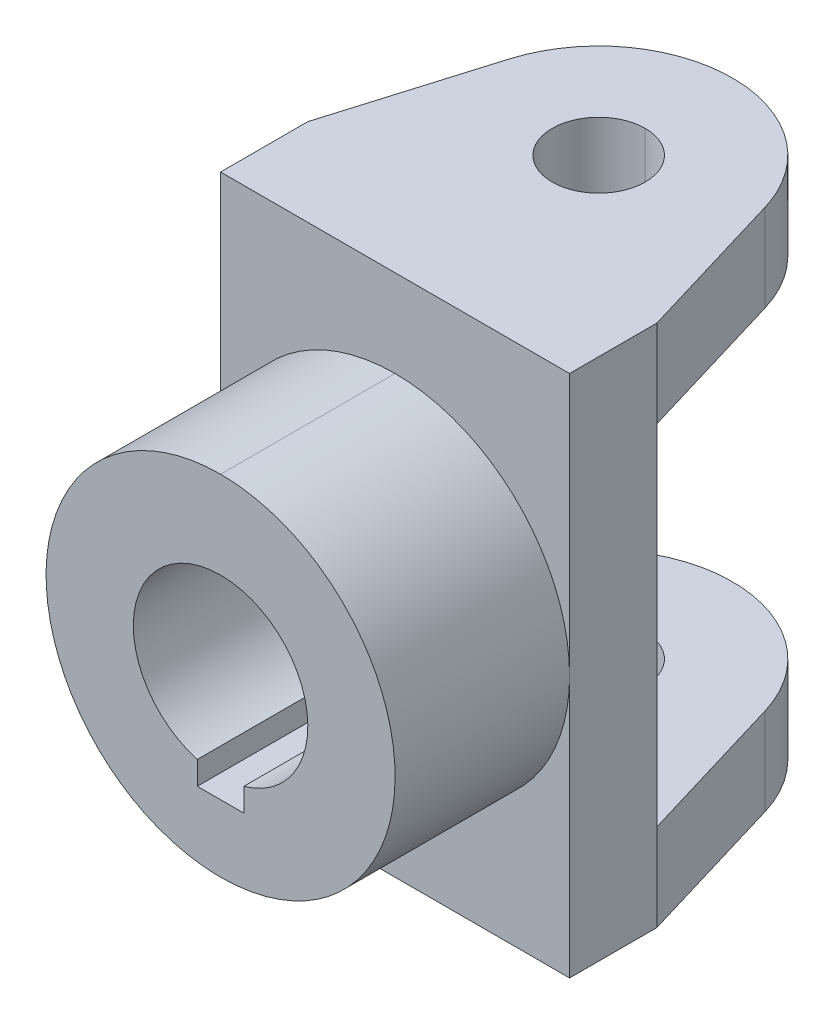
ISO-10303-21;
HEADER;
FILE_DESCRIPTION(('STEP AP214'),'2;1');
FILE_NAME('part.step','',(''),(''),'','','');
FILE_SCHEMA(('AUTOMOTIVE_DESIGN { 1 0 10303 214 1 1 1 1 }'));
ENDSEC;
DATA;
#1=APPLICATION_CONTEXT('core data for automotive mechanical design processes');
#2=APPLICATION_PROTOCOL_DEFINITION('international standard','automotive_design',2000,#1);
#3=PRODUCT_CONTEXT('',#1,'mechanical');
#4=PRODUCT('Part','Part','',(#3));
#5=PRODUCT_RELATED_PRODUCT_CATEGORY('part','',(#4));
#6=PRODUCT_DEFINITION_FORMATION('','',#4);
#7=PRODUCT_DEFINITION_CONTEXT('part definition',#1,'design');
#8=PRODUCT_DEFINITION('design','',#6,#7);
#9=PRODUCT_DEFINITION_SHAPE('','',#8);
#10=(LENGTH_UNIT() NAMED_UNIT(*) SI_UNIT(.MILLI.,.METRE.));
#11=(NAMED_UNIT(*) PLANE_ANGLE_UNIT() SI_UNIT($,.RADIAN.));
#12=(NAMED_UNIT(*) SI_UNIT($,.STERADIAN.) SOLID_ANGLE_UNIT());
#13=UNCERTAINTY_MEASURE_WITH_UNIT(LENGTH_MEASURE(1.E-05),#10,'distance_accuracy_value','');
#14=(GEOMETRIC_REPRESENTATION_CONTEXT(3) GLOBAL_UNCERTAINTY_ASSIGNED_CONTEXT((#13)) GLOBAL_UNIT_ASSIGNED_CONTEXT((#10,
#11,#12)) REPRESENTATION_CONTEXT('',''));
#15=CARTESIAN_POINT('',(0.,0.,0.));
#16=DIRECTION('',(0.,0.,1.));
#17=DIRECTION('',(1.,0.,0.));
#18=AXIS2_PLACEMENT_3D('',#15,#16,#17);
#19=CARTESIAN_POINT('',(15.0000000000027,-14.962807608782,3.97977757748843));
#20=DIRECTION('',(0.,0.,-1.));
#21=DIRECTION('',(-1.,0.,0.));
#22=AXIS2_PLACEMENT_3D('',#19,#20,#21);
#23=PLANE('',#22);
#24=CARTESIAN_POINT('',(15.0000000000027,-14.962807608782,3.97977757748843));
#25=DIRECTION('',(0.,1.,0.));
#26=VECTOR('',#25,1.);
#27=LINE('',#24,#26);
#28=CARTESIAN_POINT('',(15.0000000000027,-14.962807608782,3.97977757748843));
#29=VERTEX_POINT('',#28);
#30=CARTESIAN_POINT('',(15.0000000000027,15.037192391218,3.97977757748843));
#31=VERTEX_POINT('',#30);
#32=EDGE_CURVE('E11',#29,#31,#27,.T.);
#33=ORIENTED_EDGE('',*,*,#32,.F.);
#34=CARTESIAN_POINT('',(-14.9999999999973,-14.962807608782,3.9797775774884));
#35=DIRECTION('',(1.,0.,0.));
#36=VECTOR('',#35,1.);
#37=LINE('',#34,#36);
#38=CARTESIAN_POINT('',(-14.9999999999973,-14.962807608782,3.97977757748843));
#39=VERTEX_POINT('',#38);
#40=EDGE_CURVE('E25',#39,#29,#37,.T.);
#41=ORIENTED_EDGE('',*,*,#40,.F.);
#42=CARTESIAN_POINT('',(-14.9999999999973,15.037192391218,3.9797775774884));
#43=DIRECTION('',(0.,-1.,0.));
#44=VECTOR('',#43,1.);
#45=LINE('',#42,#44);
#46=CARTESIAN_POINT('',(-14.9999999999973,15.037192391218,3.97977757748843));
#47=VERTEX_POINT('',#46);
#48=EDGE_CURVE('E449',#47,#39,#45,.T.);
#49=ORIENTED_EDGE('',*,*,#48,.F.);
#50=CARTESIAN_POINT('',(-14.9999999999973,15.037192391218,3.97977757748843));
#51=DIRECTION('',(1.,0.,0.));
#52=VECTOR('',#51,1.);
#53=LINE('',#50,#52);
#54=EDGE_CURVE('E446',#47,#31,#53,.T.);
#55=ORIENTED_EDGE('',*,*,#54,.T.);
#56=EDGE_LOOP('',(#33,#41,#49,#55));
#57=FACE_BOUND('',#56,.T.);
#58=ADVANCED_FACE('F16',(#57),#23,.T.);
#59=CARTESIAN_POINT('',(-14.9999999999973,15.037192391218,-17.6957279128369));
#60=DIRECTION('',(0.,-1.,0.));
#61=DIRECTION('',(1.,0.,0.));
#62=AXIS2_PLACEMENT_3D('',#59,#60,#61);
#63=PLANE('',#62);
#64=CARTESIAN_POINT('',(-11.0164491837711,15.037192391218,-9.31989625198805));
#65=DIRECTION('',(-0.2869281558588,0.,0.957952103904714));
#66=VECTOR('',#65,1.);
#67=LINE('',#64,#66);
#68=CARTESIAN_POINT('',(-11.0164471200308,15.037192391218,-9.31989563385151));
#69=VERTEX_POINT('',#68);
#70=EDGE_CURVE('E444',#69,#47,#67,.T.);
#71=ORIENTED_EDGE('',*,*,#70,.F.);
#72=CARTESIAN_POINT('',(2.07852425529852E-11,15.037192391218,-6.02022242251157));
#73=DIRECTION('',(0.,1.,0.));
#74=DIRECTION('',(0.957952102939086,0.,-0.286928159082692));
#75=AXIS2_PLACEMENT_3D('',#72,#73,#74);
#76=CIRCLE('',#75,11.5);
#77=CARTESIAN_POINT('',(11.0164481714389,15.037192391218,-9.31989594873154));
#78=VERTEX_POINT('',#77);
#79=EDGE_CURVE('E441',#78,#69,#76,.T.);
#80=ORIENTED_EDGE('',*,*,#79,.F.);
#81=CARTESIAN_POINT('',(15.0000000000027,15.037192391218,3.97977757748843));
#82=DIRECTION('',(-0.286928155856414,0.,-0.957952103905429));
#83=VECTOR('',#82,1.);
#84=LINE('',#81,#83);
#85=EDGE_CURVE('E439',#31,#78,#84,.T.);
#86=ORIENTED_EDGE('',*,*,#85,.F.);
#87=ORIENTED_EDGE('',*,*,#54,.F.);
#88=EDGE_LOOP('',(#71,#80,#86,#87));
#89=FACE_BOUND('',#88,.T.);
#90=CARTESIAN_POINT('',(-0.000966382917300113,15.037192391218,-10.0202282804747));
#91=CARTESIAN_POINT('',(-0.101134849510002,15.037192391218,-10.0201769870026));
#92=CARTESIAN_POINT('',(-0.2014345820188,15.037192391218,-10.0163713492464));
#93=CARTESIAN_POINT('',(-1.1121580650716,15.037192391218,-9.94744548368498));
#94=CARTESIAN_POINT('',(-1.8835579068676,15.037192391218,-9.64087747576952));
#95=CARTESIAN_POINT('',(-3.4541185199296,15.037192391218,-8.36976583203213));
#96=CARTESIAN_POINT('',(-3.9994664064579,15.037192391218,-7.2283058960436));
#97=CARTESIAN_POINT('',(-3.9995686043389,15.037192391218,-4.7863581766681));
#98=CARTESIAN_POINT('',(-3.4309307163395,15.037192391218,-3.6228922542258));
#99=CARTESIAN_POINT('',(-1.8739302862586,15.037192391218,-2.4096738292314));
#100=CARTESIAN_POINT('',(-1.1760182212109,15.037192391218,-2.1260525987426));
#101=CARTESIAN_POINT('',(-0.2940037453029,15.037192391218,-2.0284052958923));
#102=CARTESIAN_POINT('',(-0.1470526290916,15.037192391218,-2.020283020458));
#103=CARTESIAN_POINT('',(2.07993344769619E-11,15.037192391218,-2.0202224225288));
#104=B_SPLINE_CURVE_WITH_KNOTS('',3,(#90,#91,#92,#93,#94,#95,#96,#97,#98,#99,#100,#101,#102,
#103),.UNSPECIFIED.,.F.,.F.,(4,2,2,2,2,2,4),(0.,0.0236877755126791,0.21525044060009,
0.499996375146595,0.790817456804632,0.965324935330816,1.),.UNSPECIFIED.);
#105=CARTESIAN_POINT('',(-0.000966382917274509,15.037192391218,-10.0202282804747));
#106=VERTEX_POINT('',#105);
#107=CARTESIAN_POINT('',(2.07882598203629E-11,15.037192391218,-2.02022242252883));
#108=VERTEX_POINT('',#107);
#109=EDGE_CURVE('E436',#106,#108,#104,.T.);
#110=ORIENTED_EDGE('',*,*,#109,.T.);
#111=CARTESIAN_POINT('',(2.07993344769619E-11,15.037192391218,-2.0202224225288));
#112=CARTESIAN_POINT('',(0.702485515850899,15.037192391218,-2.0205118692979));
#113=CARTESIAN_POINT('',(1.3915842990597,15.037192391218,-2.2047571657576));
#114=CARTESIAN_POINT('',(2.6107995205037,15.037192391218,-2.9088593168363));
#115=CARTESIAN_POINT('',(3.1177574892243,15.037192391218,-3.4171354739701));
#116=CARTESIAN_POINT('',(4.1804215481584,15.037192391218,-5.2674656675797));
#117=CARTESIAN_POINT('',(4.1768203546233,15.037192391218,-6.7935204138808));
#118=CARTESIAN_POINT('',(2.9852508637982,15.037192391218,-8.84443354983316));
#119=CARTESIAN_POINT('',(2.2377185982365,15.037192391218,-9.46738477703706));
#120=CARTESIAN_POINT('',(0.9157010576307,15.037192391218,-9.94138893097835));
#121=CARTESIAN_POINT('',(0.458756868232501,15.037192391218,-10.0203532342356));
#122=CARTESIAN_POINT('',(-0.000966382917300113,15.037192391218,-10.0202282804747));
#123=B_SPLINE_CURVE_WITH_KNOTS('',3,(#111,#112,#113,#114,#115,#116,#117,#118,#119,#120,#121,
#122),.UNSPECIFIED.,.F.,.F.,(4,2,2,2,2,4),(0.,0.165663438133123,0.331975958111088,
0.668821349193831,0.891268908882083,1.),.UNSPECIFIED.);
#124=EDGE_CURVE('E434',#108,#106,#123,.T.);
#125=ORIENTED_EDGE('',*,*,#124,.T.);
#126=EDGE_LOOP('',(#110,#125));
#127=FACE_BOUND('',#126,.T.);
#128=ADVANCED_FACE('F906',(#89,#127),#63,.T.);
#129=CARTESIAN_POINT('',(2.07852425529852E-11,15.037192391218,-6.02022242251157));
#130=DIRECTION('',(0.,1.,0.));
#131=DIRECTION('',(-0.999999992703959,0.,0.000120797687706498));
#132=AXIS2_PLACEMENT_3D('',#129,#130,#131);
#133=CYLINDRICAL_SURFACE('',#132,3.99999999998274);
#134=ORIENTED_EDGE('',*,*,#124,.F.);
#135=CARTESIAN_POINT('',(2.08003426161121E-11,15.037192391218,-2.02022242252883));
#136=DIRECTION('',(0.,1.,0.));
#137=VECTOR('',#136,1.);
#138=LINE('',#135,#137);
#139=CARTESIAN_POINT('',(2.07878387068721E-11,22.537192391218,-2.02022242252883));
#140=VERTEX_POINT('',#139);
#141=EDGE_CURVE('E432',#108,#140,#138,.T.);
#142=ORIENTED_EDGE('',*,*,#141,.T.);
#143=CARTESIAN_POINT('',(2.07852425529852E-11,22.537192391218,-6.02022242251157));
#144=DIRECTION('',(0.,1.,0.));
#145=DIRECTION('',(0.,0.,1.));
#146=AXIS2_PLACEMENT_3D('',#143,#144,#145);
#147=CIRCLE('',#146,3.99999999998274);
#148=CARTESIAN_POINT('',(8.38462923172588E-10,22.537192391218,-10.020240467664));
#149=VERTEX_POINT('',#148);
#150=EDGE_CURVE('E427',#140,#149,#147,.T.);
#151=ORIENTED_EDGE('',*,*,#150,.T.);
#152=CARTESIAN_POINT('',(8.38463212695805E-10,22.537192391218,-10.0202224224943));
#153=CARTESIAN_POINT('',(-4.02650916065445E-05,22.224692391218,-10.0202224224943));
#154=CARTESIAN_POINT('',(-8.05310216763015E-05,21.912192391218,-10.0202224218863));
#155=CARTESIAN_POINT('',(-0.000161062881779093,21.287192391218,-10.0202224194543));
#156=CARTESIAN_POINT('',(-0.000201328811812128,20.974692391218,-10.0202224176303));
#157=CARTESIAN_POINT('',(-0.000281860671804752,20.349692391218,-10.0202224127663));
#158=CARTESIAN_POINT('',(-0.000322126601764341,20.037192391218,-10.0202224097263));
#159=CARTESIAN_POINT('',(-0.000402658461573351,19.412192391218,-10.0202224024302));
#160=CARTESIAN_POINT('',(-0.000442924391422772,19.099692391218,-10.0202223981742));
#161=CARTESIAN_POINT('',(-0.000523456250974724,18.474692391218,-10.0202223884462));
#162=CARTESIAN_POINT('',(-0.000563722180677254,18.162192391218,-10.0202223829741));
#163=CARTESIAN_POINT('',(-0.0006442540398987,17.537192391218,-10.0202223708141));
#164=CARTESIAN_POINT('',(-0.000684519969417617,17.224692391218,-10.020222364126));
#165=CARTESIAN_POINT('',(-0.000765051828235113,16.599692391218,-10.0202223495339));
#166=CARTESIAN_POINT('',(-0.000805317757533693,16.287192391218,-10.0202223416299));
#167=CARTESIAN_POINT('',(-0.000885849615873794,15.662192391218,-10.0202223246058));
#168=CARTESIAN_POINT('',(-0.000926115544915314,15.349692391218,-10.0202223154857));
#169=CARTESIAN_POINT('',(-0.000966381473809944,15.037192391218,-10.0202223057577));
#170=B_SPLINE_CURVE_WITH_KNOTS('',3,(#152,#153,#154,#155,#156,#157,#158,#159,#160,#161,#162,
#163,#164,#165,#166,#167,#168,#169),.UNSPECIFIED.,.F.,.F.,(4,2,2,2,2,2,2,2,4),(0.,
0.937500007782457,1.87500001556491,2.81250002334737,3.75000003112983,4.68750003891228,
5.62500004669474,6.5625000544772,7.50000006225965),.UNSPECIFIED.);
#171=EDGE_CURVE('E419',#149,#106,#170,.T.);
#172=ORIENTED_EDGE('',*,*,#171,.T.);
#173=EDGE_LOOP('',(#134,#142,#151,#172));
#174=FACE_BOUND('',#173,.T.);
#175=ADVANCED_FACE('F910',(#174),#133,.F.);
#176=CARTESIAN_POINT('',(2.07852425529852E-11,15.037192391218,-6.02022242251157));
#177=DIRECTION('',(0.,1.,0.));
#178=DIRECTION('',(1.,0.,1.02208747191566E-10));
#179=AXIS2_PLACEMENT_3D('',#176,#177,#178);
#180=CYLINDRICAL_SURFACE('',#179,3.99999999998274);
#181=CARTESIAN_POINT('',(2.07852425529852E-11,22.537192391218,-6.02022242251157));
#182=DIRECTION('',(0.,1.,0.));
#183=DIRECTION('',(2.04415495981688E-10,0.,-1.));
#184=AXIS2_PLACEMENT_3D('',#181,#182,#183);
#185=CIRCLE('',#184,3.99999999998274);
#186=EDGE_CURVE('E416',#149,#140,#185,.T.);
#187=ORIENTED_EDGE('',*,*,#186,.T.);
#188=ORIENTED_EDGE('',*,*,#141,.F.);
#189=ORIENTED_EDGE('',*,*,#109,.F.);
#190=ORIENTED_EDGE('',*,*,#171,.F.);
#191=EDGE_LOOP('',(#187,#188,#189,#190));
#192=FACE_BOUND('',#191,.T.);
#193=ADVANCED_FACE('F915',(#192),#180,.F.);
#194=CARTESIAN_POINT('',(-14.9999999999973,22.537192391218,11.4797775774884));
#195=DIRECTION('',(0.,1.,0.));
#196=DIRECTION('',(1.,0.,0.));
#197=AXIS2_PLACEMENT_3D('',#194,#195,#196);
#198=PLANE('',#197);
#199=CARTESIAN_POINT('',(15.0000000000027,22.537192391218,11.4797775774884));
#200=DIRECTION('',(0.,0.,-1.));
#201=VECTOR('',#200,1.);
#202=LINE('',#199,#201);
#203=CARTESIAN_POINT('',(15.0000000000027,22.537192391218,11.4797775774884));
#204=VERTEX_POINT('',#203);
#205=CARTESIAN_POINT('',(15.0000000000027,22.537192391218,3.97977757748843));
#206=VERTEX_POINT('',#205);
#207=EDGE_CURVE('E414',#204,#206,#202,.T.);
#208=ORIENTED_EDGE('',*,*,#207,.T.);
#209=CARTESIAN_POINT('',(15.0000000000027,22.537192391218,3.9797775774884));
#210=CARTESIAN_POINT('',(13.6721524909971,22.537192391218,-0.453447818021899));
#211=CARTESIAN_POINT('',(12.3443049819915,22.537192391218,-4.8866732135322));
#212=CARTESIAN_POINT('',(11.01644918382,22.537192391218,-9.3198962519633));
#213=B_SPLINE_CURVE_WITH_KNOTS('',3,(#209,#210,#211,#212),.UNSPECIFIED.,.F.,.F.,(4,4),(0.,1.),.UNSPECIFIED.);
#214=CARTESIAN_POINT('',(11.0164491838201,22.537192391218,-9.31989625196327));
#215=VERTEX_POINT('',#214);
#216=EDGE_CURVE('E412',#206,#215,#213,.T.);
#217=ORIENTED_EDGE('',*,*,#216,.T.);
#218=CARTESIAN_POINT('',(11.01644918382,22.537192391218,-9.3198962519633));
#219=CARTESIAN_POINT('',(11.0164491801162,22.537192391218,-9.319896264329));
#220=CARTESIAN_POINT('',(11.0164491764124,22.537192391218,-9.3198962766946));
#221=CARTESIAN_POINT('',(10.3065655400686,22.537192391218,-11.68992793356));
#222=CARTESIAN_POINT('',(8.8513296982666,22.537192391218,-13.7678078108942));
#223=CARTESIAN_POINT('',(4.5629984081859,22.537192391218,-16.9599186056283));
#224=CARTESIAN_POINT('',(1.7009850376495,22.537192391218,-17.7507169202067));
#225=CARTESIAN_POINT('',(-3.7842044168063,22.537192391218,-17.1963584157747));
#226=CARTESIAN_POINT('',(-6.24056616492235,22.537192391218,-16.034290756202));
#227=CARTESIAN_POINT('',(-9.46916921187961,22.537192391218,-12.8208343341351));
#228=CARTESIAN_POINT('',(-10.4672628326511,22.537192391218,-11.1534165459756));
#229=CARTESIAN_POINT('',(-11.0164474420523,22.537192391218,-9.3198957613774));
#230=CARTESIAN_POINT('',(-11.0164474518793,22.537192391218,-9.3198957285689));
#231=CARTESIAN_POINT('',(-11.0164474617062,22.537192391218,-9.3198956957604));
#232=B_SPLINE_CURVE_WITH_KNOTS('',3,(#218,#219,#220,#221,#222,#223,#224,#225,#226,#227,#228,
#229,#230,#231),.UNSPECIFIED.,.F.,.F.,(4,2,2,2,2,2,4),(0.,2.E-08,3.83324331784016,
8.2828763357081,12.3751179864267,15.3406150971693,15.3406151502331),.UNSPECIFIED.);
#233=CARTESIAN_POINT('',(-11.0164474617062,22.537192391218,-9.31989569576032));
#234=VERTEX_POINT('',#233);
#235=EDGE_CURVE('E409',#215,#234,#232,.T.);
#236=ORIENTED_EDGE('',*,*,#235,.T.);
#237=CARTESIAN_POINT('',(-11.0164474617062,22.537192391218,-9.3198956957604));
#238=CARTESIAN_POINT('',(-12.3443029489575,22.537192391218,-4.886672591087));
#239=CARTESIAN_POINT('',(-13.6721514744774,22.537192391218,-0.4534475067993));
#240=CARTESIAN_POINT('',(-14.9999999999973,22.537192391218,3.9797775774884));
#241=B_SPLINE_CURVE_WITH_KNOTS('',3,(#237,#238,#239,#240),.UNSPECIFIED.,.F.,.F.,(4,4),(0.,1.),.UNSPECIFIED.);
#242=CARTESIAN_POINT('',(-14.9999999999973,22.537192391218,3.97977757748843));
#243=VERTEX_POINT('',#242);
#244=EDGE_CURVE('E407',#234,#243,#241,.T.);
#245=ORIENTED_EDGE('',*,*,#244,.T.);
#246=CARTESIAN_POINT('',(-14.9999999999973,22.537192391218,11.4797775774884));
#247=DIRECTION('',(0.,0.,-1.));
#248=VECTOR('',#247,1.);
#249=LINE('',#246,#248);
#250=CARTESIAN_POINT('',(-14.9999999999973,22.537192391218,11.4797775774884));
#251=VERTEX_POINT('',#250);
#252=EDGE_CURVE('E405',#251,#243,#249,.T.);
#253=ORIENTED_EDGE('',*,*,#252,.F.);
#254=CARTESIAN_POINT('',(15.0000000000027,22.537192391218,11.4797775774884));
#255=DIRECTION('',(-1.,0.,0.));
#256=VECTOR('',#255,1.);
#257=LINE('',#254,#256);
#258=EDGE_CURVE('E403',#204,#251,#257,.T.);
#259=ORIENTED_EDGE('',*,*,#258,.F.);
#260=EDGE_LOOP('',(#208,#217,#236,#245,#253,#259));
#261=FACE_BOUND('',#260,.T.);
#262=ORIENTED_EDGE('',*,*,#150,.F.);
#263=ORIENTED_EDGE('',*,*,#186,.F.);
#264=EDGE_LOOP('',(#262,#263));
#265=FACE_BOUND('',#264,.T.);
#266=ADVANCED_FACE('F1359',(#261,#265),#198,.T.);
#267=CARTESIAN_POINT('',(15.0000000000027,0.0371923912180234,11.4797775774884));
#268=DIRECTION('',(0.,0.,1.));
#269=DIRECTION('',(0.,1.,0.));
#270=AXIS2_PLACEMENT_3D('',#267,#268,#269);
#271=PLANE('',#270);
#272=CARTESIAN_POINT('',(2.73891423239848E-12,0.0371923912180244,11.4797775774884));
#273=DIRECTION('',(0.,0.,1.));
#274=DIRECTION('',(-2.42334781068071E-13,1.,0.));
#275=AXIS2_PLACEMENT_3D('',#272,#273,#274);
#276=CIRCLE('',#275,15.);
#277=CARTESIAN_POINT('',(-9.09462430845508E-13,15.0371929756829,11.4797775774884));
#278=VERTEX_POINT('',#277);
#279=CARTESIAN_POINT('',(-14.9999999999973,0.0371923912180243,11.4797775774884));
#280=VERTEX_POINT('',#279);
#281=EDGE_CURVE('E401',#278,#280,#276,.T.);
#282=ORIENTED_EDGE('',*,*,#281,.F.);
#283=CARTESIAN_POINT('',(2.73891423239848E-12,0.0371923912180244,11.4797775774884));
#284=DIRECTION('',(0.,0.,1.));
#285=DIRECTION('',(1.,0.,0.));
#286=AXIS2_PLACEMENT_3D('',#283,#284,#285);
#287=CIRCLE('',#286,15.);
#288=CARTESIAN_POINT('',(15.0000000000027,0.0371923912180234,11.4797775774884));
#289=VERTEX_POINT('',#288);
#290=EDGE_CURVE('E399',#289,#278,#287,.T.);
#291=ORIENTED_EDGE('',*,*,#290,.F.);
#292=CARTESIAN_POINT('',(15.0000000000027,0.0371923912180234,11.4797775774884));
#293=DIRECTION('',(0.,1.,0.));
#294=VECTOR('',#293,1.);
#295=LINE('',#292,#294);
#296=EDGE_CURVE('E393',#289,#204,#295,.T.);
#297=ORIENTED_EDGE('',*,*,#296,.T.);
#298=ORIENTED_EDGE('',*,*,#258,.T.);
#299=CARTESIAN_POINT('',(-14.9999999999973,22.537192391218,11.4797775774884));
#300=DIRECTION('',(0.,-1.,0.));
#301=VECTOR('',#300,1.);
#302=LINE('',#299,#301);
#303=EDGE_CURVE('E388',#251,#280,#302,.T.);
#304=ORIENTED_EDGE('',*,*,#303,.T.);
#305=EDGE_LOOP('',(#282,#291,#297,#298,#304));
#306=FACE_BOUND('',#305,.T.);
#307=ADVANCED_FACE('F1353',(#306),#271,.T.);
#308=CARTESIAN_POINT('',(-14.9999999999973,-22.462807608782,11.4797775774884));
#309=DIRECTION('',(-1.,0.,0.));
#310=DIRECTION('',(0.,1.,0.));
#311=AXIS2_PLACEMENT_3D('',#308,#309,#310);
#312=PLANE('',#311);
#313=CARTESIAN_POINT('',(-14.9999999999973,22.537192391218,3.9797775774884));
#314=DIRECTION('',(0.,-1.,0.));
#315=VECTOR('',#314,1.);
#316=LINE('',#313,#315);
#317=EDGE_CURVE('E384',#243,#47,#316,.T.);
#318=ORIENTED_EDGE('',*,*,#317,.T.);
#319=ORIENTED_EDGE('',*,*,#48,.T.);
#320=CARTESIAN_POINT('',(-14.9999999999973,-14.962807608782,3.9797775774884));
#321=DIRECTION('',(0.,-1.,0.));
#322=VECTOR('',#321,1.);
#323=LINE('',#320,#322);
#324=CARTESIAN_POINT('',(-14.9999999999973,-22.462807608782,3.97977757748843));
#325=VERTEX_POINT('',#324);
#326=EDGE_CURVE('E381',#39,#325,#323,.T.);
#327=ORIENTED_EDGE('',*,*,#326,.T.);
#328=CARTESIAN_POINT('',(-14.9999999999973,-22.462807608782,11.4797775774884));
#329=DIRECTION('',(0.,0.,-1.));
#330=VECTOR('',#329,1.);
#331=LINE('',#328,#330);
#332=CARTESIAN_POINT('',(-14.9999999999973,-22.462807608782,11.4797775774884));
#333=VERTEX_POINT('',#332);
#334=EDGE_CURVE('E377',#333,#325,#331,.T.);
#335=ORIENTED_EDGE('',*,*,#334,.F.);
#336=CARTESIAN_POINT('',(-14.9999999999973,0.0371923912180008,11.4797775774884));
#337=DIRECTION('',(0.,-1.,0.));
#338=VECTOR('',#337,1.);
#339=LINE('',#336,#338);
#340=EDGE_CURVE('E375',#280,#333,#339,.T.);
#341=ORIENTED_EDGE('',*,*,#340,.F.);
#342=ORIENTED_EDGE('',*,*,#303,.F.);
#343=ORIENTED_EDGE('',*,*,#252,.T.);
#344=EDGE_LOOP('',(#318,#319,#327,#335,#341,#342,#343));
#345=FACE_BOUND('',#344,.T.);
#346=ADVANCED_FACE('F1347',(#345),#312,.T.);
#347=CARTESIAN_POINT('',(15.0000000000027,-22.462807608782,11.4797775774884));
#348=DIRECTION('',(0.,0.,1.));
#349=DIRECTION('',(0.,1.,0.));
#350=AXIS2_PLACEMENT_3D('',#347,#348,#349);
#351=PLANE('',#350);
#352=CARTESIAN_POINT('',(2.73891423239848E-12,0.0371923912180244,11.4797775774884));
#353=DIRECTION('',(0.,0.,1.));
#354=DIRECTION('',(-3.1690360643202E-12,-1.,0.));
#355=AXIS2_PLACEMENT_3D('',#352,#353,#354);
#356=CIRCLE('',#355,15.);
#357=CARTESIAN_POINT('',(-4.48257066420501E-11,-14.9628057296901,11.4797775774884));
#358=VERTEX_POINT('',#357);
#359=EDGE_CURVE('E370',#358,#289,#356,.T.);
#360=ORIENTED_EDGE('',*,*,#359,.F.);
#361=CARTESIAN_POINT('',(2.73891423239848E-12,0.0371923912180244,11.4797775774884));
#362=DIRECTION('',(0.,0.,1.));
#363=DIRECTION('',(-1.,0.,0.));
#364=AXIS2_PLACEMENT_3D('',#361,#362,#363);
#365=CIRCLE('',#364,15.);
#366=EDGE_CURVE('E365',#280,#358,#365,.T.);
#367=ORIENTED_EDGE('',*,*,#366,.F.);
#368=ORIENTED_EDGE('',*,*,#340,.T.);
#369=CARTESIAN_POINT('',(-14.9999999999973,-22.462807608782,11.4797775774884));
#370=DIRECTION('',(1.,0.,0.));
#371=VECTOR('',#370,1.);
#372=LINE('',#369,#371);
#373=CARTESIAN_POINT('',(15.0000000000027,-22.462807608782,11.4797775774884));
#374=VERTEX_POINT('',#373);
#375=EDGE_CURVE('E361',#333,#374,#372,.T.);
#376=ORIENTED_EDGE('',*,*,#375,.T.);
#377=CARTESIAN_POINT('',(15.0000000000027,-22.462807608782,11.4797775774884));
#378=DIRECTION('',(0.,1.,0.));
#379=VECTOR('',#378,1.);
#380=LINE('',#377,#379);
#381=EDGE_CURVE('E358',#374,#289,#380,.T.);
#382=ORIENTED_EDGE('',*,*,#381,.T.);
#383=EDGE_LOOP('',(#360,#367,#368,#376,#382));
#384=FACE_BOUND('',#383,.T.);
#385=ADVANCED_FACE('F1010',(#384),#351,.T.);
#386=CARTESIAN_POINT('',(15.0000000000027,-22.462807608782,3.97977757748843));
#387=DIRECTION('',(1.,0.,0.));
#388=DIRECTION('',(0.,1.,0.));
#389=AXIS2_PLACEMENT_3D('',#386,#387,#388);
#390=PLANE('',#389);
#391=CARTESIAN_POINT('',(15.0000000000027,-22.462807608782,3.97977757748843));
#392=DIRECTION('',(0.,1.,0.));
#393=VECTOR('',#392,1.);
#394=LINE('',#391,#393);
#395=CARTESIAN_POINT('',(15.0000000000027,-22.462807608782,3.97977757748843));
#396=VERTEX_POINT('',#395);
#397=EDGE_CURVE('E354',#396,#29,#394,.T.);
#398=ORIENTED_EDGE('',*,*,#397,.T.);
#399=ORIENTED_EDGE('',*,*,#32,.T.);
#400=CARTESIAN_POINT('',(15.0000000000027,15.037192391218,3.97977757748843));
#401=DIRECTION('',(0.,1.,0.));
#402=VECTOR('',#401,1.);
#403=LINE('',#400,#402);
#404=EDGE_CURVE('E348',#31,#206,#403,.T.);
#405=ORIENTED_EDGE('',*,*,#404,.T.);
#406=ORIENTED_EDGE('',*,*,#207,.F.);
#407=ORIENTED_EDGE('',*,*,#296,.F.);
#408=ORIENTED_EDGE('',*,*,#381,.F.);
#409=CARTESIAN_POINT('',(15.0000000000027,-22.462807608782,11.4797775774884));
#410=DIRECTION('',(0.,0.,-1.));
#411=VECTOR('',#410,1.);
#412=LINE('',#409,#411);
#413=EDGE_CURVE('E346',#374,#396,#412,.T.);
#414=ORIENTED_EDGE('',*,*,#413,.T.);
#415=EDGE_LOOP('',(#398,#399,#405,#406,#407,#408,#414));
#416=FACE_BOUND('',#415,.T.);
#417=ADVANCED_FACE('F991',(#416),#390,.T.);
#418=CARTESIAN_POINT('',(-14.9999999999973,-22.462807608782,-17.7507165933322));
#419=DIRECTION('',(0.,-1.,0.));
#420=DIRECTION('',(1.,0.,0.));
#421=AXIS2_PLACEMENT_3D('',#418,#419,#420);
#422=PLANE('',#421);
#423=ORIENTED_EDGE('',*,*,#334,.T.);
#424=CARTESIAN_POINT('',(-11.0164491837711,-22.462807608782,-9.31989625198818));
#425=DIRECTION('',(-0.2869281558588,0.,0.957952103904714));
#426=VECTOR('',#425,1.);
#427=LINE('',#424,#426);
#428=CARTESIAN_POINT('',(-11.016447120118,-22.462807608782,-9.31989563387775));
#429=VERTEX_POINT('',#428);
#430=EDGE_CURVE('E344',#429,#325,#427,.T.);
#431=ORIENTED_EDGE('',*,*,#430,.F.);
#432=CARTESIAN_POINT('',(2.07852425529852E-11,-22.462807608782,-6.02022242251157));
#433=DIRECTION('',(0.,1.,0.));
#434=DIRECTION('',(0.957952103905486,0.,-0.286928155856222));
#435=AXIS2_PLACEMENT_3D('',#432,#433,#434);
#436=CIRCLE('',#435,11.5);
#437=CARTESIAN_POINT('',(11.0164474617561,-22.462807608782,-9.31989569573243));
#438=VERTEX_POINT('',#437);
#439=EDGE_CURVE('E339',#438,#429,#436,.T.);
#440=ORIENTED_EDGE('',*,*,#439,.F.);
#441=CARTESIAN_POINT('',(15.0000000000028,-22.462807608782,3.97977757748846));
#442=DIRECTION('',(-0.286928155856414,0.,-0.957952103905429));
#443=VECTOR('',#442,1.);
#444=LINE('',#441,#443);
#445=EDGE_CURVE('E337',#396,#438,#444,.T.);
#446=ORIENTED_EDGE('',*,*,#445,.F.);
#447=ORIENTED_EDGE('',*,*,#413,.F.);
#448=ORIENTED_EDGE('',*,*,#375,.F.);
#449=EDGE_LOOP('',(#423,#431,#440,#446,#447,#448));
#450=FACE_BOUND('',#449,.T.);
#451=CARTESIAN_POINT('',(2.06987205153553E-11,-22.462807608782,-2.0202224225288));
#452=CARTESIAN_POINT('',(0.728666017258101,-22.462807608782,-2.020518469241));
#453=CARTESIAN_POINT('',(1.4424238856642,-22.462807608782,-2.2187546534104));
#454=CARTESIAN_POINT('',(2.6702481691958,-22.462807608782,-2.9597496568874));
#455=CARTESIAN_POINT('',(3.167339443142,-22.462807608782,-3.4776821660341));
#456=CARTESIAN_POINT('',(3.9695963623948,-22.462807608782,-4.9390647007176));
#457=CARTESIAN_POINT('',(4.1129114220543,-22.462807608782,-5.9212324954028));
#458=CARTESIAN_POINT('',(3.6872149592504,-22.462807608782,-7.90001618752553));
#459=CARTESIAN_POINT('',(3.0593611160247,-22.462807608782,-8.80709702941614));
#460=CARTESIAN_POINT('',(1.5204308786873,-22.462807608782,-9.79915868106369));
#461=CARTESIAN_POINT('',(0.7689666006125,-22.462807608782,-10.0199100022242));
#462=CARTESIAN_POINT('',(2.07993344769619E-11,-22.462807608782,-10.0202224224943));
#463=B_SPLINE_CURVE_WITH_KNOTS('',3,(#451,#452,#453,#454,#455,#456,#457,#458,#459,#460,#461,
#462),.UNSPECIFIED.,.F.,.F.,(4,2,2,2,2,4),(0.,0.172433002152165,0.339322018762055,
0.566912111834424,0.818091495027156,1.),.UNSPECIFIED.);
#464=CARTESIAN_POINT('',(2.07845537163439E-11,-22.462807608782,-2.02022242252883));
#465=VERTEX_POINT('',#464);
#466=CARTESIAN_POINT('',(2.07869733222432E-11,-22.462807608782,-10.0202224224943));
#467=VERTEX_POINT('',#466);
#468=EDGE_CURVE('E333',#465,#467,#463,.T.);
#469=ORIENTED_EDGE('',*,*,#468,.T.);
#470=CARTESIAN_POINT('',(2.07993344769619E-11,-22.462807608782,-10.0202224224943));
#471=CARTESIAN_POINT('',(-0.7286660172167,-22.462807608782,-10.0199263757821));
#472=CARTESIAN_POINT('',(-1.4424238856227,-22.462807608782,-9.82169019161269));
#473=CARTESIAN_POINT('',(-2.6702481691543,-22.462807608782,-9.08069518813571));
#474=CARTESIAN_POINT('',(-3.1673394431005,-22.462807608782,-8.56276267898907));
#475=CARTESIAN_POINT('',(-3.9695963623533,-22.462807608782,-7.1013801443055));
#476=CARTESIAN_POINT('',(-4.1129114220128,-22.462807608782,-6.1192123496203));
#477=CARTESIAN_POINT('',(-3.6872149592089,-22.462807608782,-4.1404286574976));
#478=CARTESIAN_POINT('',(-3.0593611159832,-22.462807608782,-3.233347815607));
#479=CARTESIAN_POINT('',(-1.5204308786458,-22.462807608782,-2.2412861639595));
#480=CARTESIAN_POINT('',(-0.768966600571,-22.462807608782,-2.0205348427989));
#481=CARTESIAN_POINT('',(2.06987205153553E-11,-22.462807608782,-2.0202224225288));
#482=B_SPLINE_CURVE_WITH_KNOTS('',3,(#470,#471,#472,#473,#474,#475,#476,#477,#478,#479,#480,
#481),.UNSPECIFIED.,.F.,.F.,(4,2,2,2,2,4),(0.,0.172433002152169,0.339322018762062,
0.566912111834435,0.818091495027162,1.),.UNSPECIFIED.);
#483=EDGE_CURVE('E331',#467,#465,#482,.T.);
#484=ORIENTED_EDGE('',*,*,#483,.T.);
#485=EDGE_LOOP('',(#469,#484));
#486=FACE_BOUND('',#485,.T.);
#487=ADVANCED_FACE('F1009',(#450,#486),#422,.T.);
#488=CARTESIAN_POINT('',(2.07852425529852E-11,-14.962807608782,-6.02022242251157));
#489=DIRECTION('',(0.,-1.,0.));
#490=DIRECTION('',(1.,0.,0.));
#491=AXIS2_PLACEMENT_3D('',#488,#489,#490);
#492=CYLINDRICAL_SURFACE('',#491,3.99999999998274);
#493=ORIENTED_EDGE('',*,*,#483,.F.);
#494=CARTESIAN_POINT('',(2.080034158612E-11,-14.962807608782,-10.0202224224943));
#495=DIRECTION('',(0.,-1.,0.));
#496=VECTOR('',#495,1.);
#497=LINE('',#494,#496);
#498=CARTESIAN_POINT('',(2.07864834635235E-11,-14.962807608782,-10.0202224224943));
#499=VERTEX_POINT('',#498);
#500=EDGE_CURVE('E328',#499,#467,#497,.T.);
#501=ORIENTED_EDGE('',*,*,#500,.F.);
#502=CARTESIAN_POINT('',(2.07852425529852E-11,-14.962807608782,-6.02022242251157));
#503=DIRECTION('',(0.,1.,0.));
#504=DIRECTION('',(0.,0.,-1.));
#505=AXIS2_PLACEMENT_3D('',#502,#503,#504);
#506=CIRCLE('',#505,3.99999999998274);
#507=CARTESIAN_POINT('',(2.07827773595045E-11,-14.962807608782,-2.02022242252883));
#508=VERTEX_POINT('',#507);
#509=EDGE_CURVE('E324',#499,#508,#506,.T.);
#510=ORIENTED_EDGE('',*,*,#509,.T.);
#511=CARTESIAN_POINT('',(2.07839560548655E-11,-22.462807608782,-2.02022242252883));
#512=DIRECTION('',(0.,1.,0.));
#513=VECTOR('',#512,1.);
#514=LINE('',#511,#513);
#515=EDGE_CURVE('E317',#465,#508,#514,.T.);
#516=ORIENTED_EDGE('',*,*,#515,.F.);
#517=EDGE_LOOP('',(#493,#501,#510,#516));
#518=FACE_BOUND('',#517,.T.);
#519=ADVANCED_FACE('F1119',(#518),#492,.F.);
#520=CARTESIAN_POINT('',(2.07852425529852E-11,-14.962807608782,-6.02022242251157));
#521=DIRECTION('',(0.,-1.,0.));
#522=DIRECTION('',(-1.,0.,0.));
#523=AXIS2_PLACEMENT_3D('',#520,#521,#522);
#524=CYLINDRICAL_SURFACE('',#523,3.99999999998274);
#525=CARTESIAN_POINT('',(2.07852425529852E-11,-14.962807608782,-6.02022242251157));
#526=DIRECTION('',(0.,1.,0.));
#527=DIRECTION('',(0.,0.,1.));
#528=AXIS2_PLACEMENT_3D('',#525,#526,#527);
#529=CIRCLE('',#528,3.99999999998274);
#530=EDGE_CURVE('E313',#508,#499,#529,.T.);
#531=ORIENTED_EDGE('',*,*,#530,.T.);
#532=ORIENTED_EDGE('',*,*,#500,.T.);
#533=ORIENTED_EDGE('',*,*,#468,.F.);
#534=ORIENTED_EDGE('',*,*,#515,.T.);
#535=EDGE_LOOP('',(#531,#532,#533,#534));
#536=FACE_BOUND('',#535,.T.);
#537=ADVANCED_FACE('F1128',(#536),#524,.F.);
#538=CARTESIAN_POINT('',(15.0000000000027,-14.962807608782,-17.6957279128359));
#539=DIRECTION('',(0.,1.,0.));
#540=DIRECTION('',(-1.,0.,0.));
#541=AXIS2_PLACEMENT_3D('',#538,#539,#540);
#542=PLANE('',#541);
#543=CARTESIAN_POINT('',(15.0000000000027,-14.962807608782,3.9797775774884));
#544=CARTESIAN_POINT('',(13.6721519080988,-14.962807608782,-0.453447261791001));
#545=CARTESIAN_POINT('',(12.3443038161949,-14.962807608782,-4.8866721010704));
#546=CARTESIAN_POINT('',(11.0164471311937,-14.962807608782,-9.31989559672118));
#547=B_SPLINE_CURVE_WITH_KNOTS('',3,(#543,#544,#545,#546),.UNSPECIFIED.,.F.,.F.,(4,4),(0.,1.),.UNSPECIFIED.);
#548=CARTESIAN_POINT('',(11.0164471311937,-14.962807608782,-9.31989559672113));
#549=VERTEX_POINT('',#548);
#550=EDGE_CURVE('E311',#29,#549,#547,.T.);
#551=ORIENTED_EDGE('',*,*,#550,.T.);
#552=CARTESIAN_POINT('',(11.0164471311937,-14.962807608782,-9.31989559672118));
#553=CARTESIAN_POINT('',(11.0164470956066,-14.962807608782,-9.31989571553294));
#554=CARTESIAN_POINT('',(11.0164470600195,-14.962807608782,-9.31989583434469));
#555=CARTESIAN_POINT('',(10.3065638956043,-14.962807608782,-11.6899266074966));
#556=CARTESIAN_POINT('',(8.85132831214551,-14.962807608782,-13.767806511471));
#557=CARTESIAN_POINT('',(5.5437424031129,-14.962807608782,-16.2298790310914));
#558=CARTESIAN_POINT('',(4.0244334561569,-14.962807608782,-16.918569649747));
#559=CARTESIAN_POINT('',(0.401286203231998,-14.962807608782,-17.6957279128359));
#560=CARTESIAN_POINT('',(-1.6881245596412,-14.962807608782,-17.5800017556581));
#561=CARTESIAN_POINT('',(-6.2455063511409,-14.962807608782,-16.0598812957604));
#562=CARTESIAN_POINT('',(-8.4547188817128,-14.962807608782,-14.2857397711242));
#563=CARTESIAN_POINT('',(-10.3564661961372,-14.962807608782,-11.1097767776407));
#564=CARTESIAN_POINT('',(-10.7427528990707,-14.962807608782,-10.233663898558));
#565=CARTESIAN_POINT('',(-11.0164481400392,-14.962807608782,-9.31989605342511));
#566=CARTESIAN_POINT('',(-11.0164481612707,-14.962807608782,-9.31989598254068));
#567=CARTESIAN_POINT('',(-11.0164481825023,-14.962807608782,-9.31989591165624));
#568=B_SPLINE_CURVE_WITH_KNOTS('',3,(#552,#553,#554,#555,#556,#557,#558,#559,#560,#561,#562,
#563,#564,#565,#566,#567),.UNSPECIFIED.,.F.,.F.,(4,2,2,2,2,2,2,4),(0.,3.35225886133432E-08,
0.668701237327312,1.11447359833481,1.67025617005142,2.41298090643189,2.67079993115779,
2.67079995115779),.UNSPECIFIED.);
#569=CARTESIAN_POINT('',(-11.0164481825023,-14.962807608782,-9.3198959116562));
#570=VERTEX_POINT('',#569);
#571=EDGE_CURVE('E307',#549,#570,#568,.T.);
#572=ORIENTED_EDGE('',*,*,#571,.T.);
#573=CARTESIAN_POINT('',(-11.0164481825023,-14.962807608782,-9.31989591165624));
#574=CARTESIAN_POINT('',(-12.3443015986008,-14.962807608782,-4.8866718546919));
#575=CARTESIAN_POINT('',(-13.6721507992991,-14.962807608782,-0.453447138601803));
#576=CARTESIAN_POINT('',(-14.9999999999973,-14.962807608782,3.9797775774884));
#577=B_SPLINE_CURVE_WITH_KNOTS('',3,(#573,#574,#575,#576),.UNSPECIFIED.,.F.,.F.,(4,4),(0.,1.),.UNSPECIFIED.);
#578=EDGE_CURVE('E300',#570,#39,#577,.T.);
#579=ORIENTED_EDGE('',*,*,#578,.T.);
#580=ORIENTED_EDGE('',*,*,#40,.T.);
#581=EDGE_LOOP('',(#551,#572,#579,#580));
#582=FACE_BOUND('',#581,.T.);
#583=ORIENTED_EDGE('',*,*,#509,.F.);
#584=ORIENTED_EDGE('',*,*,#530,.F.);
#585=EDGE_LOOP('',(#583,#584));
#586=FACE_BOUND('',#585,.T.);
#587=ADVANCED_FACE('F454',(#582,#586),#542,.T.);
#588=CARTESIAN_POINT('',(-14.9999999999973,-22.462807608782,3.97977757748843));
#589=DIRECTION('',(-0.957952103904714,0.,-0.2869281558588));
#590=DIRECTION('',(0.,1.,0.));
#591=AXIS2_PLACEMENT_3D('',#588,#589,#590);
#592=PLANE('',#591);
#593=ORIENTED_EDGE('',*,*,#430,.T.);
#594=ORIENTED_EDGE('',*,*,#326,.F.);
#595=ORIENTED_EDGE('',*,*,#578,.F.);
#596=CARTESIAN_POINT('',(-11.0164491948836,-14.962807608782,-9.31989621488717));
#597=DIRECTION('',(1.48167797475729E-09,-1.,-4.94680083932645E-09));
#598=VECTOR('',#597,1.);
#599=LINE('',#596,#598);
#600=EDGE_CURVE('E292',#570,#429,#599,.T.);
#601=ORIENTED_EDGE('',*,*,#600,.T.);
#602=EDGE_LOOP('',(#593,#594,#595,#601));
#603=FACE_BOUND('',#602,.T.);
#604=ADVANCED_FACE('F1197',(#603),#592,.T.);
#605=CARTESIAN_POINT('',(2.07852425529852E-11,-14.962807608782,-6.02022242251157));
#606=DIRECTION('',(0.,-1.,0.));
#607=DIRECTION('',(-1.33759670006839E-12,0.,1.));
#608=AXIS2_PLACEMENT_3D('',#605,#606,#607);
#609=CYLINDRICAL_SURFACE('',#608,11.5);
#610=ORIENTED_EDGE('',*,*,#439,.T.);
#611=ORIENTED_EDGE('',*,*,#600,.F.);
#612=ORIENTED_EDGE('',*,*,#571,.F.);
#613=CARTESIAN_POINT('',(11.016449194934,-14.962807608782,-9.31989621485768));
#614=DIRECTION('',(0.,-1.,0.));
#615=VECTOR('',#614,1.);
#616=LINE('',#613,#615);
#617=EDGE_CURVE('E285',#549,#438,#616,.T.);
#618=ORIENTED_EDGE('',*,*,#617,.T.);
#619=EDGE_LOOP('',(#610,#611,#612,#618));
#620=FACE_BOUND('',#619,.T.);
#621=ADVANCED_FACE('F480',(#620),#609,.T.);
#622=CARTESIAN_POINT('',(11.0164491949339,-22.462807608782,-9.31989621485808));
#623=DIRECTION('',(0.957952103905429,0.,-0.286928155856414));
#624=DIRECTION('',(0.,1.,0.));
#625=AXIS2_PLACEMENT_3D('',#622,#623,#624);
#626=PLANE('',#625);
#627=ORIENTED_EDGE('',*,*,#445,.T.);
#628=ORIENTED_EDGE('',*,*,#617,.F.);
#629=ORIENTED_EDGE('',*,*,#550,.F.);
#630=ORIENTED_EDGE('',*,*,#397,.F.);
#631=EDGE_LOOP('',(#627,#628,#629,#630));
#632=FACE_BOUND('',#631,.T.);
#633=ADVANCED_FACE('F459',(#632),#626,.T.);
#634=CARTESIAN_POINT('',(15.0000000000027,15.037192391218,3.97977757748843));
#635=DIRECTION('',(0.957952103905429,0.,-0.286928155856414));
#636=DIRECTION('',(-0.286928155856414,0.,-0.957952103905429));
#637=AXIS2_PLACEMENT_3D('',#634,#635,#636);
#638=PLANE('',#637);
#639=ORIENTED_EDGE('',*,*,#216,.F.);
#640=ORIENTED_EDGE('',*,*,#404,.F.);
#641=ORIENTED_EDGE('',*,*,#85,.T.);
#642=CARTESIAN_POINT('',(11.0164491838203,15.037192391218,-9.31989625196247));
#643=DIRECTION('',(0.,1.,-1.022330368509E-13));
#644=VECTOR('',#643,1.);
#645=LINE('',#642,#644);
#646=EDGE_CURVE('E277',#78,#215,#645,.T.);
#647=ORIENTED_EDGE('',*,*,#646,.T.);
#648=EDGE_LOOP('',(#639,#640,#641,#647));
#649=FACE_BOUND('',#648,.T.);
#650=ADVANCED_FACE('F479',(#649),#638,.T.);
#651=CARTESIAN_POINT('',(2.07852425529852E-11,15.037192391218,-6.02022242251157));
#652=DIRECTION('',(0.,1.,0.));
#653=DIRECTION('',(1.68278035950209E-09,0.,1.));
#654=AXIS2_PLACEMENT_3D('',#651,#652,#653);
#655=CYLINDRICAL_SURFACE('',#654,11.5);
#656=ORIENTED_EDGE('',*,*,#235,.F.);
#657=ORIENTED_EDGE('',*,*,#646,.F.);
#658=ORIENTED_EDGE('',*,*,#79,.T.);
#659=CARTESIAN_POINT('',(-11.0164491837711,15.037192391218,-9.31989625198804));
#660=CARTESIAN_POINT('',(-11.0164491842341,15.349692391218,-9.31989625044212));
#661=CARTESIAN_POINT('',(-11.0164491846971,15.662192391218,-9.3198962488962));
#662=CARTESIAN_POINT('',(-11.0164491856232,16.287192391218,-9.31989624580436));
#663=CARTESIAN_POINT('',(-11.0164491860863,16.599692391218,-9.31989624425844));
#664=CARTESIAN_POINT('',(-11.0164491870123,17.224692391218,-9.3198962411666));
#665=CARTESIAN_POINT('',(-11.0164491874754,17.537192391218,-9.31989623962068));
#666=CARTESIAN_POINT('',(-11.0164491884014,18.162192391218,-9.31989623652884));
#667=CARTESIAN_POINT('',(-11.0164491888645,18.474692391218,-9.31989623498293));
#668=CARTESIAN_POINT('',(-11.0164491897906,19.099692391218,-9.31989623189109));
#669=CARTESIAN_POINT('',(-11.0164491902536,19.412192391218,-9.31989623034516));
#670=CARTESIAN_POINT('',(-11.0164491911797,20.037192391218,-9.31989622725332));
#671=CARTESIAN_POINT('',(-11.0164491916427,20.349692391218,-9.31989622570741));
#672=CARTESIAN_POINT('',(-11.0164491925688,20.974692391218,-9.31989622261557));
#673=CARTESIAN_POINT('',(-11.0164491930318,21.287192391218,-9.31989622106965));
#674=CARTESIAN_POINT('',(-11.0164491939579,21.912192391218,-9.31989621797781));
#675=CARTESIAN_POINT('',(-11.0164491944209,22.224692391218,-9.31989621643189));
#676=CARTESIAN_POINT('',(-11.016449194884,22.537192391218,-9.31989621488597));
#677=B_SPLINE_CURVE_WITH_KNOTS('',3,(#659,#660,#661,#662,#663,#664,#665,#666,#667,#668,#669,
#670,#671,#672,#673,#674,#675,#676),.UNSPECIFIED.,.F.,.F.,(4,2,2,2,2,2,2,2,4),(0.,
0.937500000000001,1.875,2.8125,3.75,4.6875,5.625,6.5625,7.5),.UNSPECIFIED.);
#678=EDGE_CURVE('E273',#69,#234,#677,.T.);
#679=ORIENTED_EDGE('',*,*,#678,.T.);
#680=EDGE_LOOP('',(#656,#657,#658,#679));
#681=FACE_BOUND('',#680,.T.);
#682=ADVANCED_FACE('F538',(#681),#655,.T.);
#683=CARTESIAN_POINT('',(-11.0164491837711,15.037192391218,-9.31989625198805));
#684=DIRECTION('',(-0.957952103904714,0.,-0.2869281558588));
#685=DIRECTION('',(-0.2869281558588,0.,0.957952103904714));
#686=AXIS2_PLACEMENT_3D('',#683,#684,#685);
#687=PLANE('',#686);
#688=ORIENTED_EDGE('',*,*,#244,.F.);
#689=ORIENTED_EDGE('',*,*,#678,.F.);
#690=ORIENTED_EDGE('',*,*,#70,.T.);
#691=ORIENTED_EDGE('',*,*,#317,.F.);
#692=EDGE_LOOP('',(#688,#689,#690,#691));
#693=FACE_BOUND('',#692,.T.);
#694=ADVANCED_FACE('F547',(#693),#687,.T.);
#695=CARTESIAN_POINT('',(2.73891423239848E-12,0.0371923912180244,26.4797775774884));
#696=DIRECTION('',(0.,0.,-1.));
#697=DIRECTION('',(1.,1.22246997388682E-13,0.));
#698=AXIS2_PLACEMENT_3D('',#695,#696,#697);
#699=CYLINDRICAL_SURFACE('',#698,15.);
#700=ORIENTED_EDGE('',*,*,#281,.T.);
#701=ORIENTED_EDGE('',*,*,#366,.T.);
#702=CARTESIAN_POINT('',(2.75200496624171E-12,-14.962807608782,26.4797775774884));
#703=DIRECTION('',(-3.16990877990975E-12,0.,-1.));
#704=VECTOR('',#703,1.);
#705=LINE('',#702,#704);
#706=CARTESIAN_POINT('',(2.76222695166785E-12,-14.962807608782,26.4797775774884));
#707=VERTEX_POINT('',#706);
#708=EDGE_CURVE('E270',#707,#358,#705,.T.);
#709=ORIENTED_EDGE('',*,*,#708,.F.);
#710=CARTESIAN_POINT('',(-1.16000958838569E-11,15.037192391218,26.4797775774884));
#711=CARTESIAN_POINT('',(-1.9012629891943,15.0371769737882,26.4797775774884));
#712=CARTESIAN_POINT('',(-3.7989885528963,14.6757465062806,26.4797775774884));
#713=CARTESIAN_POINT('',(-8.52737362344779,12.7773353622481,26.4797775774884));
#714=CARTESIAN_POINT('',(-11.01722917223,10.6977889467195,26.4797775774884));
#715=CARTESIAN_POINT('',(-14.24017248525,5.5672960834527,26.4797775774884));
#716=CARTESIAN_POINT('',(-15.0378412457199,2.7257253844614,26.4797775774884));
#717=CARTESIAN_POINT('',(-14.9609637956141,-2.9428265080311,26.4797775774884));
#718=CARTESIAN_POINT('',(-14.153304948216,-5.654488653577,26.4797775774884));
#719=CARTESIAN_POINT('',(-11.1547392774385,-10.3802820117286,26.4797775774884));
#720=CARTESIAN_POINT('',(-9.00335071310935,-12.2872498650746,26.4797775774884));
#721=CARTESIAN_POINT('',(-4.4411580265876,-14.463500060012,26.4797775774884));
#722=CARTESIAN_POINT('',(-2.2347206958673,-14.9627998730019,26.4797775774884));
#723=CARTESIAN_POINT('',(2.79984369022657E-12,-14.962807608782,26.4797775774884));
#724=B_SPLINE_CURVE_WITH_KNOTS('',3,(#710,#711,#712,#713,#714,#715,#716,#717,#718,#719,#720,
#721,#722,#723),.UNSPECIFIED.,.F.,.F.,(4,2,2,2,2,2,4),(0.,0.121918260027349,0.322097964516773,
0.504928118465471,0.680469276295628,0.85873209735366,1.),.UNSPECIFIED.);
#725=CARTESIAN_POINT('',(-1.15709018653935E-11,15.037192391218,26.4797775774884));
#726=VERTEX_POINT('',#725);
#727=EDGE_CURVE('E265',#726,#707,#724,.T.);
#728=ORIENTED_EDGE('',*,*,#727,.F.);
#729=CARTESIAN_POINT('',(-9.82704879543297E-13,15.037192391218,11.4797775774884));
#730=DIRECTION('',(-7.09876601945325E-13,0.,1.));
#731=VECTOR('',#730,1.);
#732=LINE('',#729,#731);
#733=EDGE_CURVE('E259',#278,#726,#732,.T.);
#734=ORIENTED_EDGE('',*,*,#733,.F.);
#735=EDGE_LOOP('',(#700,#701,#709,#728,#734));
#736=FACE_BOUND('',#735,.T.);
#737=ADVANCED_FACE('F615',(#736),#699,.T.);
#738=CARTESIAN_POINT('',(2.73891423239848E-12,0.0371923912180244,26.4797775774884));
#739=DIRECTION('',(0.,0.,-1.));
#740=DIRECTION('',(-1.,1.10864582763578E-12,0.));
#741=AXIS2_PLACEMENT_3D('',#738,#739,#740);
#742=CYLINDRICAL_SURFACE('',#741,15.);
#743=CARTESIAN_POINT('',(2.79984369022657E-12,-14.962807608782,26.4797775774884));
#744=CARTESIAN_POINT('',(3.9782865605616,-14.9627489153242,26.4797775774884));
#745=CARTESIAN_POINT('',(7.7935118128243,-13.3824998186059,26.4797775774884));
#746=CARTESIAN_POINT('',(13.4196916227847,-7.75632058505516,26.4797775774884));
#747=CARTESIAN_POINT('',(14.9999410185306,-3.9410956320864,26.4797775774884));
#748=CARTESIAN_POINT('',(14.9999895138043,3.0039229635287,26.4797775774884));
#749=CARTESIAN_POINT('',(14.1202732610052,5.9039929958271,26.4797775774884));
#750=CARTESIAN_POINT('',(10.5596403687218,11.2328596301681,26.4797775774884));
#751=CARTESIAN_POINT('',(7.7210111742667,13.3501524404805,26.4797775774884));
#752=CARTESIAN_POINT('',(2.9864728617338,14.8146068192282,26.4797775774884));
#753=CARTESIAN_POINT('',(1.4921470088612,15.0372047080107,26.4797775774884));
#754=CARTESIAN_POINT('',(-1.16000958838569E-11,15.037192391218,26.4797775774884));
#755=B_SPLINE_CURVE_WITH_KNOTS('',3,(#743,#744,#745,#746,#747,#748,#749,#750,#751,#752,#753,
#754),.UNSPECIFIED.,.F.,.F.,(4,2,2,2,2,4),(0.,0.250535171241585,0.501070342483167,
0.687902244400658,0.90467917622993,1.),.UNSPECIFIED.);
#756=EDGE_CURVE('E256',#707,#726,#755,.T.);
#757=ORIENTED_EDGE('',*,*,#756,.F.);
#758=ORIENTED_EDGE('',*,*,#708,.T.);
#759=ORIENTED_EDGE('',*,*,#359,.T.);
#760=ORIENTED_EDGE('',*,*,#290,.T.);
#761=ORIENTED_EDGE('',*,*,#733,.T.);
#762=EDGE_LOOP('',(#757,#758,#759,#760,#761));
#763=FACE_BOUND('',#762,.T.);
#764=ADVANCED_FACE('F624',(#763),#742,.T.);
#765=CARTESIAN_POINT('',(-15.0378412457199,-14.962807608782,26.4797775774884));
#766=DIRECTION('',(0.,0.,1.));
#767=DIRECTION('',(1.,0.,0.));
#768=AXIS2_PLACEMENT_3D('',#765,#766,#767);
#769=PLANE('',#768);
#770=ORIENTED_EDGE('',*,*,#727,.T.);
#771=ORIENTED_EDGE('',*,*,#756,.T.);
#772=EDGE_LOOP('',(#770,#771));
#773=FACE_BOUND('',#772,.T.);
#774=CARTESIAN_POINT('',(-1.99999999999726,-9.19122375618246,26.4797775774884));
#775=DIRECTION('',(1.,0.,0.));
#776=VECTOR('',#775,1.);
#777=LINE('',#774,#776);
#778=CARTESIAN_POINT('',(-1.99999999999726,-9.19122375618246,26.4797775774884));
#779=VERTEX_POINT('',#778);
#780=CARTESIAN_POINT('',(2.00000000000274,-9.19122375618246,26.4797775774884));
#781=VERTEX_POINT('',#780);
#782=EDGE_CURVE('E255',#779,#781,#777,.T.);
#783=ORIENTED_EDGE('',*,*,#782,.F.);
#784=CARTESIAN_POINT('',(-1.99999999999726,-7.19122375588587,26.4797775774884));
#785=DIRECTION('',(0.,-1.,0.));
#786=VECTOR('',#785,1.);
#787=LINE('',#784,#786);
#788=CARTESIAN_POINT('',(-2.00000000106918,-7.19122375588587,26.4797775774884));
#789=VERTEX_POINT('',#788);
#790=EDGE_CURVE('E196',#789,#779,#787,.T.);
#791=ORIENTED_EDGE('',*,*,#790,.F.);
#792=CARTESIAN_POINT('',(2.73891423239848E-12,0.0371923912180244,26.4797775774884));
#793=DIRECTION('',(0.,0.,1.));
#794=DIRECTION('',(1.38858452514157E-10,1.,0.));
#795=AXIS2_PLACEMENT_3D('',#792,#793,#794);
#796=CIRCLE('',#795,7.5);
#797=CARTESIAN_POINT('',(1.04419125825E-09,7.53721223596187,26.4797775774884));
#798=VERTEX_POINT('',#797);
#799=EDGE_CURVE('E251',#798,#789,#796,.T.);
#800=ORIENTED_EDGE('',*,*,#799,.F.);
#801=CARTESIAN_POINT('',(2.73891423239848E-12,0.0371923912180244,26.4797775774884));
#802=DIRECTION('',(0.,0.,1.));
#803=DIRECTION('',(0.266666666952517,-0.963788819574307,0.));
#804=AXIS2_PLACEMENT_3D('',#801,#802,#803);
#805=CIRCLE('',#804,7.5);
#806=CARTESIAN_POINT('',(2.00000000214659,-7.19122375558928,26.4797775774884));
#807=VERTEX_POINT('',#806);
#808=EDGE_CURVE('E248',#807,#798,#805,.T.);
#809=ORIENTED_EDGE('',*,*,#808,.F.);
#810=CARTESIAN_POINT('',(2.00000000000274,-9.19122375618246,26.4797775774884));
#811=DIRECTION('',(0.,1.,0.));
#812=VECTOR('',#811,1.);
#813=LINE('',#810,#812);
#814=EDGE_CURVE('E246',#781,#807,#813,.T.);
#815=ORIENTED_EDGE('',*,*,#814,.F.);
#816=EDGE_LOOP('',(#783,#791,#800,#809,#815));
#817=FACE_BOUND('',#816,.T.);
#818=ADVANCED_FACE('F700',(#773,#817),#769,.T.);
#819=CARTESIAN_POINT('',(2.00000000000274,-9.19122375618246,11.4797775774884));
#820=DIRECTION('',(-1.,0.,0.));
#821=DIRECTION('',(0.,0.,1.));
#822=AXIS2_PLACEMENT_3D('',#819,#820,#821);
#823=PLANE('',#822);
#824=CARTESIAN_POINT('',(2.00000000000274,-9.19122375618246,11.4797775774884));
#825=DIRECTION('',(5.35960164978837E-10,1.,0.));
#826=VECTOR('',#825,1.);
#827=LINE('',#824,#826);
#828=CARTESIAN_POINT('',(2.00000000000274,-9.19122375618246,11.4797775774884));
#829=VERTEX_POINT('',#828);
#830=CARTESIAN_POINT('',(2.00000000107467,-7.19122375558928,11.4797775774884));
#831=VERTEX_POINT('',#830);
#832=EDGE_CURVE('E245',#829,#831,#827,.T.);
#833=ORIENTED_EDGE('',*,*,#832,.F.);
#834=CARTESIAN_POINT('',(2.00000000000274,-9.19122375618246,26.4797775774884));
#835=DIRECTION('',(0.,0.,-1.));
#836=VECTOR('',#835,1.);
#837=LINE('',#834,#836);
#838=EDGE_CURVE('E190',#781,#829,#837,.T.);
#839=ORIENTED_EDGE('',*,*,#838,.F.);
#840=ORIENTED_EDGE('',*,*,#814,.T.);
#841=CARTESIAN_POINT('',(2.00000000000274,-7.19122375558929,26.4797775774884));
#842=DIRECTION('',(0.,0.,-1.));
#843=VECTOR('',#842,1.);
#844=LINE('',#841,#843);
#845=EDGE_CURVE('E238',#807,#831,#844,.T.);
#846=ORIENTED_EDGE('',*,*,#845,.T.);
#847=EDGE_LOOP('',(#833,#839,#840,#846));
#848=FACE_BOUND('',#847,.T.);
#849=ADVANCED_FACE('F709',(#848),#823,.T.);
#850=CARTESIAN_POINT('',(2.73891423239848E-12,0.0371923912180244,26.4797775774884));
#851=DIRECTION('',(0.,0.,-1.));
#852=DIRECTION('',(-0.990905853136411,-0.13455701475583,0.));
#853=AXIS2_PLACEMENT_3D('',#850,#851,#852);
#854=CYLINDRICAL_SURFACE('',#853,7.5);
#855=CARTESIAN_POINT('',(2.00000000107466,-7.19122375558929,11.4797775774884));
#856=CARTESIAN_POINT('',(3.39395944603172,-6.80512880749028,11.4797775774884));
#857=CARTESIAN_POINT('',(4.64525083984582,-6.0262283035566,11.4797775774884));
#858=CARTESIAN_POINT('',(6.40833148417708,-4.04200476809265,11.4797775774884));
#859=CARTESIAN_POINT('',(6.98102287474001,-2.95840407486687,11.4797775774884));
#860=CARTESIAN_POINT('',(7.64134755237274,-0.32590785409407,11.4797775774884));
#861=CARTESIAN_POINT('',(7.55895970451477,1.21334667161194,11.4797775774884));
#862=CARTESIAN_POINT('',(6.50957963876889,4.06551629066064,11.4797775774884));
#863=CARTESIAN_POINT('',(5.5517653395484,5.30705399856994,11.4797775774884));
#864=CARTESIAN_POINT('',(3.03103249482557,7.06877639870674,11.4797775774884));
#865=CARTESIAN_POINT('',(1.53136380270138,7.53729876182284,11.4797775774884));
#866=CARTESIAN_POINT('',(-1.43280960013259E-09,7.53720468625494,11.4797775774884));
#867=B_SPLINE_CURVE_WITH_KNOTS('',3,(#855,#856,#857,#858,#859,#860,#861,#862,#863,#864,#865,
#866),.UNSPECIFIED.,.F.,.F.,(4,2,2,2,2,4),(0.,0.199917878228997,0.366841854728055,
0.575034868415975,0.786801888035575,1.),.UNSPECIFIED.);
#868=CARTESIAN_POINT('',(-1.43281271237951E-09,7.53720468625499,11.4797775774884));
#869=VERTEX_POINT('',#868);
#870=EDGE_CURVE('E236',#831,#869,#867,.T.);
#871=ORIENTED_EDGE('',*,*,#870,.F.);
#872=ORIENTED_EDGE('',*,*,#845,.F.);
#873=ORIENTED_EDGE('',*,*,#808,.T.);
#874=CARTESIAN_POINT('',(-1.43284128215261E-09,7.53719239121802,11.4797775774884));
#875=CARTESIAN_POINT('',(-1.32963787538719E-09,7.53719239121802,12.1047775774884));
#876=CARTESIAN_POINT('',(-1.22642742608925E-09,7.53719239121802,12.7297775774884));
#877=CARTESIAN_POINT('',(-1.02000423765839E-09,7.53719239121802,13.9797775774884));
#878=CARTESIAN_POINT('',(-9.16791498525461E-10,7.53719239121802,14.6047775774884));
#879=CARTESIAN_POINT('',(-7.10375525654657E-10,7.53719239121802,15.8547775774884));
#880=CARTESIAN_POINT('',(-6.07172291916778E-10,7.53719239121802,16.4797775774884));
#881=CARTESIAN_POINT('',(-4.00756738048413E-10,7.53719239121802,17.7297775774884));
#882=CARTESIAN_POINT('',(-2.97544417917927E-10,7.53719239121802,18.3547775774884));
#883=CARTESIAN_POINT('',(-9.11199724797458E-11,7.53719239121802,19.6047775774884));
#884=CARTESIAN_POINT('',(1.209215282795E-11,7.53719239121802,20.2297775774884));
#885=CARTESIAN_POINT('',(2.18507680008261E-10,7.53719239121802,21.4797775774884));
#886=CARTESIAN_POINT('',(3.21711081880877E-10,7.53719239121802,22.1047775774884));
#887=CARTESIAN_POINT('',(5.28127161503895E-10,7.53719239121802,23.3547775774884));
#888=CARTESIAN_POINT('',(6.31339839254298E-10,7.53719239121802,23.9797775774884));
#889=CARTESIAN_POINT('',(8.37763043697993E-10,7.53719239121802,25.2297775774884));
#890=CARTESIAN_POINT('',(9.40973570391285E-10,7.53719239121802,25.8547775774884));
#891=CARTESIAN_POINT('',(1.04417730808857E-09,7.53719239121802,26.4797775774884));
#892=B_SPLINE_CURVE_WITH_KNOTS('',3,(#874,#875,#876,#877,#878,#879,#880,#881,#882,#883,#884,
#885,#886,#887,#888,#889,#890,#891),.UNSPECIFIED.,.F.,.F.,(4,2,2,2,2,2,2,2,4),(0.,1.875,3.75,
5.625,7.5,9.375,11.25,13.125,15.),.UNSPECIFIED.);
#893=EDGE_CURVE('E234',#869,#798,#892,.T.);
#894=ORIENTED_EDGE('',*,*,#893,.F.);
#895=EDGE_LOOP('',(#871,#872,#873,#894));
#896=FACE_BOUND('',#895,.T.);
#897=ADVANCED_FACE('F791',(#896),#854,.F.);
#898=CARTESIAN_POINT('',(2.73891423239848E-12,0.0371923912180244,26.4797775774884));
#899=DIRECTION('',(0.,0.,-1.));
#900=DIRECTION('',(0.990905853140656,-0.134557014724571,0.));
#901=AXIS2_PLACEMENT_3D('',#898,#899,#900);
#902=CYLINDRICAL_SURFACE('',#901,7.5);
#903=ORIENTED_EDGE('',*,*,#799,.T.);
#904=CARTESIAN_POINT('',(-2.00000000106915,-7.19122375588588,26.4797775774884));
#905=DIRECTION('',(0.,0.,-1.));
#906=VECTOR('',#905,1.);
#907=LINE('',#904,#906);
#908=CARTESIAN_POINT('',(-2.00000000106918,-7.19122375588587,11.4797775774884));
#909=VERTEX_POINT('',#908);
#910=EDGE_CURVE('E230',#789,#909,#907,.T.);
#911=ORIENTED_EDGE('',*,*,#910,.T.);
#912=CARTESIAN_POINT('',(-1.43280960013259E-09,7.53720468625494,11.4797775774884));
#913=CARTESIAN_POINT('',(-0.236933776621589,7.53719097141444,11.4797775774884));
#914=CARTESIAN_POINT('',(-0.474626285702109,7.52595927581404,11.4797775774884));
#915=CARTESIAN_POINT('',(-2.43453563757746,7.33922519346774,11.4797775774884));
#916=CARTESIAN_POINT('',(-4.04596780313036,6.58454641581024,11.4797775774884));
#917=CARTESIAN_POINT('',(-6.45163684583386,4.20403612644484,11.4797775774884));
#918=CARTESIAN_POINT('',(-7.20917770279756,2.68609536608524,11.4797775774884));
#919=CARTESIAN_POINT('',(-7.59437370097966,-0.151176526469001,11.4797775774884));
#920=CARTESIAN_POINT('',(-7.46556972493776,-1.36892169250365,11.4797775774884));
#921=CARTESIAN_POINT('',(-6.58433375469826,-3.81339061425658,11.4797775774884));
#922=CARTESIAN_POINT('',(-5.75842374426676,-4.96512992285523,11.4797775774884));
#923=CARTESIAN_POINT('',(-3.88078509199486,-6.45971745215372,11.4797775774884));
#924=CARTESIAN_POINT('',(-2.97286391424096,-6.92176265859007,11.4797775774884));
#925=CARTESIAN_POINT('',(-2.00000000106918,-7.19122375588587,11.4797775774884));
#926=B_SPLINE_CURVE_WITH_KNOTS('',3,(#912,#913,#914,#915,#916,#917,#918,#919,#920,#921,#922,
#923,#924,#925),.UNSPECIFIED.,.F.,.F.,(4,2,2,2,2,2,4),(0.,0.0330169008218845,0.272236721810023,
0.501034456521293,0.668128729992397,0.860384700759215,1.),.UNSPECIFIED.);
#927=EDGE_CURVE('E173',#869,#909,#926,.T.);
#928=ORIENTED_EDGE('',*,*,#927,.F.);
#929=ORIENTED_EDGE('',*,*,#893,.T.);
#930=EDGE_LOOP('',(#903,#911,#928,#929));
#931=FACE_BOUND('',#930,.T.);
#932=ADVANCED_FACE('F800',(#931),#902,.F.);
#933=CARTESIAN_POINT('',(7.64134755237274,-9.19122375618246,11.4797775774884));
#934=DIRECTION('',(0.,0.,1.));
#935=DIRECTION('',(0.,1.,0.));
#936=AXIS2_PLACEMENT_3D('',#933,#934,#935);
#937=PLANE('',#936);
#938=ORIENTED_EDGE('',*,*,#870,.T.);
#939=ORIENTED_EDGE('',*,*,#927,.T.);
#940=CARTESIAN_POINT('',(-2.00000000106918,-7.19122375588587,11.4797775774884));
#941=DIRECTION('',(5.35960165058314E-10,-1.,0.));
#942=VECTOR('',#941,1.);
#943=LINE('',#940,#942);
#944=CARTESIAN_POINT('',(-1.99999999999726,-9.19122375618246,11.4797775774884));
#945=VERTEX_POINT('',#944);
#946=EDGE_CURVE('E163',#909,#945,#943,.T.);
#947=ORIENTED_EDGE('',*,*,#946,.T.);
#948=CARTESIAN_POINT('',(-1.99999999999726,-9.19122375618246,11.4797775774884));
#949=DIRECTION('',(1.,0.,0.));
#950=VECTOR('',#949,1.);
#951=LINE('',#948,#950);
#952=EDGE_CURVE('E169',#945,#829,#951,.T.);
#953=ORIENTED_EDGE('',*,*,#952,.T.);
#954=ORIENTED_EDGE('',*,*,#832,.T.);
#955=EDGE_LOOP('',(#938,#939,#947,#953,#954));
#956=FACE_BOUND('',#955,.T.);
#957=ADVANCED_FACE('F167',(#956),#937,.T.);
#958=CARTESIAN_POINT('',(-1.99999999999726,-9.19122375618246,11.4797775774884));
#959=DIRECTION('',(0.,1.,0.));
#960=DIRECTION('',(0.,0.,1.));
#961=AXIS2_PLACEMENT_3D('',#958,#959,#960);
#962=PLANE('',#961);
#963=ORIENTED_EDGE('',*,*,#952,.F.);
#964=CARTESIAN_POINT('',(-1.99999999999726,-9.19122375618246,26.4797775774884));
#965=DIRECTION('',(0.,0.,-1.));
#966=VECTOR('',#965,1.);
#967=LINE('',#964,#966);
#968=EDGE_CURVE('E186',#779,#945,#967,.T.);
#969=ORIENTED_EDGE('',*,*,#968,.F.);
#970=ORIENTED_EDGE('',*,*,#782,.T.);
#971=ORIENTED_EDGE('',*,*,#838,.T.);
#972=EDGE_LOOP('',(#963,#969,#970,#971));
#973=FACE_BOUND('',#972,.T.);
#974=ADVANCED_FACE('F184',(#973),#962,.T.);
#975=CARTESIAN_POINT('',(-1.99999999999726,-9.19122375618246,26.4797775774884));
#976=DIRECTION('',(1.,0.,0.));
#977=DIRECTION('',(0.,0.,-1.));
#978=AXIS2_PLACEMENT_3D('',#975,#976,#977);
#979=PLANE('',#978);
#980=ORIENTED_EDGE('',*,*,#946,.F.);
#981=ORIENTED_EDGE('',*,*,#910,.F.);
#982=ORIENTED_EDGE('',*,*,#790,.T.);
#983=ORIENTED_EDGE('',*,*,#968,.T.);
#984=EDGE_LOOP('',(#980,#981,#982,#983));
#985=FACE_BOUND('',#984,.T.);
#986=ADVANCED_FACE('F195',(#985),#979,.T.);
#987=CLOSED_SHELL('',(#58,#128,#175,#193,#266,#307,#346,#385,#417,#487,#519,#537,#587,#604,#621,
#633,#650,#682,#694,#737,#764,#818,#849,#897,#932,#957,#974,#986));
#988=MANIFOLD_SOLID_BREP('B1',#987);
#989=ADVANCED_BREP_SHAPE_REPRESENTATION('',(#18,#988),#14);
#990=SHAPE_DEFINITION_REPRESENTATION(#9,#989);
ENDSEC;
END-ISO-10303-21;
